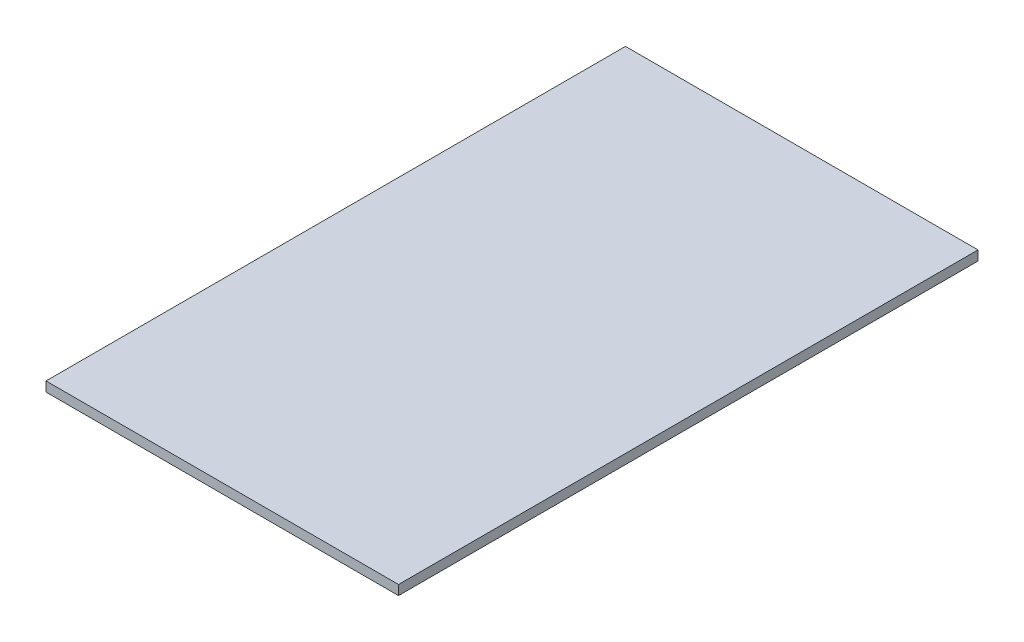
ISO-10303-21;
HEADER;
FILE_DESCRIPTION(('STEP AP214'),'2;1');
FILE_NAME('part.step','',(''),(''),'','','');
FILE_SCHEMA(('AUTOMOTIVE_DESIGN { 1 0 10303 214 1 1 1 1 }'));
ENDSEC;
DATA;
#1=APPLICATION_CONTEXT('core data for automotive mechanical design processes');
#2=APPLICATION_PROTOCOL_DEFINITION('international standard','automotive_design',2000,#1);
#3=PRODUCT_CONTEXT('',#1,'mechanical');
#4=PRODUCT('Part','Part','',(#3));
#5=PRODUCT_RELATED_PRODUCT_CATEGORY('part','',(#4));
#6=PRODUCT_DEFINITION_FORMATION('','',#4);
#7=PRODUCT_DEFINITION_CONTEXT('part definition',#1,'design');
#8=PRODUCT_DEFINITION('design','',#6,#7);
#9=PRODUCT_DEFINITION_SHAPE('','',#8);
#10=(LENGTH_UNIT() NAMED_UNIT(*) SI_UNIT(.MILLI.,.METRE.));
#11=(NAMED_UNIT(*) PLANE_ANGLE_UNIT() SI_UNIT($,.RADIAN.));
#12=(NAMED_UNIT(*) SI_UNIT($,.STERADIAN.) SOLID_ANGLE_UNIT());
#13=UNCERTAINTY_MEASURE_WITH_UNIT(LENGTH_MEASURE(1.E-05),#10,'distance_accuracy_value','');
#14=(GEOMETRIC_REPRESENTATION_CONTEXT(3) GLOBAL_UNCERTAINTY_ASSIGNED_CONTEXT((#13)) GLOBAL_UNIT_ASSIGNED_CONTEXT((#10,
#11,#12)) REPRESENTATION_CONTEXT('',''));
#15=CARTESIAN_POINT('',(0.,0.,0.));
#16=DIRECTION('',(0.,0.,1.));
#17=DIRECTION('',(1.,0.,0.));
#18=AXIS2_PLACEMENT_3D('',#15,#16,#17);
#19=CARTESIAN_POINT('',(0.,25.4,0.));
#20=DIRECTION('',(1.,0.,0.));
#21=DIRECTION('',(0.,0.,-1.));
#22=AXIS2_PLACEMENT_3D('',#19,#20,#21);
#23=PLANE('',#22);
#24=DIRECTION('',(0.,0.,1.));
#25=VECTOR('',#24,1.);
#26=CARTESIAN_POINT('',(0.,0.,0.));
#27=LINE('',#26,#25);
#28=CARTESIAN_POINT('',(0.,0.,-1524.));
#29=VERTEX_POINT('',#28);
#30=CARTESIAN_POINT('',(0.,0.,0.));
#31=VERTEX_POINT('',#30);
#32=EDGE_CURVE('E100',#29,#31,#27,.T.);
#33=ORIENTED_EDGE('',*,*,#32,.T.);
#34=DIRECTION('',(0.,-1.,0.));
#35=VECTOR('',#34,1.);
#36=CARTESIAN_POINT('',(0.,25.4,0.));
#37=LINE('',#36,#35);
#38=CARTESIAN_POINT('',(0.,25.4,0.));
#39=VERTEX_POINT('',#38);
#40=EDGE_CURVE('E11',#39,#31,#37,.T.);
#41=ORIENTED_EDGE('',*,*,#40,.F.);
#42=DIRECTION('',(0.,0.,1.));
#43=VECTOR('',#42,1.);
#44=CARTESIAN_POINT('',(0.,25.4,0.));
#45=LINE('',#44,#43);
#46=CARTESIAN_POINT('',(0.,25.4,-1524.));
#47=VERTEX_POINT('',#46);
#48=EDGE_CURVE('E88',#47,#39,#45,.T.);
#49=ORIENTED_EDGE('',*,*,#48,.F.);
#50=DIRECTION('',(0.,-1.,0.));
#51=VECTOR('',#50,1.);
#52=CARTESIAN_POINT('',(0.,25.4,-1524.));
#53=LINE('',#52,#51);
#54=EDGE_CURVE('E96',#47,#29,#53,.T.);
#55=ORIENTED_EDGE('',*,*,#54,.T.);
#56=EDGE_LOOP('',(#33,#41,#49,#55));
#57=FACE_BOUND('',#56,.T.);
#58=ADVANCED_FACE('F37',(#57),#23,.F.);
#59=CARTESIAN_POINT('',(0.,25.4,0.));
#60=DIRECTION('',(0.,0.,-1.));
#61=DIRECTION('',(-1.,0.,0.));
#62=AXIS2_PLACEMENT_3D('',#59,#60,#61);
#63=PLANE('',#62);
#64=DIRECTION('',(1.,0.,0.));
#65=VECTOR('',#64,1.);
#66=CARTESIAN_POINT('',(0.,0.,0.));
#67=LINE('',#66,#65);
#68=CARTESIAN_POINT('',(927.1,0.,0.));
#69=VERTEX_POINT('',#68);
#70=EDGE_CURVE('E92',#31,#69,#67,.T.);
#71=ORIENTED_EDGE('',*,*,#70,.T.);
#72=DIRECTION('',(0.,-1.,0.));
#73=VECTOR('',#72,1.);
#74=CARTESIAN_POINT('',(927.1,25.4,0.));
#75=LINE('',#74,#73);
#76=CARTESIAN_POINT('',(927.1,25.4,0.));
#77=VERTEX_POINT('',#76);
#78=EDGE_CURVE('E45',#77,#69,#75,.T.);
#79=ORIENTED_EDGE('',*,*,#78,.F.);
#80=DIRECTION('',(1.,0.,0.));
#81=VECTOR('',#80,1.);
#82=CARTESIAN_POINT('',(0.,25.4,0.));
#83=LINE('',#82,#81);
#84=EDGE_CURVE('E83',#39,#77,#83,.T.);
#85=ORIENTED_EDGE('',*,*,#84,.F.);
#86=ORIENTED_EDGE('',*,*,#40,.T.);
#87=EDGE_LOOP('',(#71,#79,#85,#86));
#88=FACE_BOUND('',#87,.T.);
#89=ADVANCED_FACE('F91',(#88),#63,.F.);
#90=CARTESIAN_POINT('',(927.1,25.4,0.));
#91=DIRECTION('',(-1.,0.,0.));
#92=DIRECTION('',(0.,0.,1.));
#93=AXIS2_PLACEMENT_3D('',#90,#91,#92);
#94=PLANE('',#93);
#95=DIRECTION('',(0.,0.,-1.));
#96=VECTOR('',#95,1.);
#97=CARTESIAN_POINT('',(927.1,0.,0.));
#98=LINE('',#97,#96);
#99=CARTESIAN_POINT('',(927.1,0.,-1524.));
#100=VERTEX_POINT('',#99);
#101=EDGE_CURVE('E70',#69,#100,#98,.T.);
#102=ORIENTED_EDGE('',*,*,#101,.T.);
#103=DIRECTION('',(0.,-1.,0.));
#104=VECTOR('',#103,1.);
#105=CARTESIAN_POINT('',(927.1,25.4,-1524.));
#106=LINE('',#105,#104);
#107=CARTESIAN_POINT('',(927.1,25.4,-1524.));
#108=VERTEX_POINT('',#107);
#109=EDGE_CURVE('E93',#108,#100,#106,.T.);
#110=ORIENTED_EDGE('',*,*,#109,.F.);
#111=DIRECTION('',(0.,0.,-1.));
#112=VECTOR('',#111,1.);
#113=CARTESIAN_POINT('',(927.1,25.4,0.));
#114=LINE('',#113,#112);
#115=EDGE_CURVE('E86',#77,#108,#114,.T.);
#116=ORIENTED_EDGE('',*,*,#115,.F.);
#117=ORIENTED_EDGE('',*,*,#78,.T.);
#118=EDGE_LOOP('',(#102,#110,#116,#117));
#119=FACE_BOUND('',#118,.T.);
#120=ADVANCED_FACE('F94',(#119),#94,.F.);
#121=CARTESIAN_POINT('',(0.,25.4,-1524.));
#122=DIRECTION('',(0.,0.,1.));
#123=DIRECTION('',(1.,0.,0.));
#124=AXIS2_PLACEMENT_3D('',#121,#122,#123);
#125=PLANE('',#124);
#126=DIRECTION('',(-1.,0.,0.));
#127=VECTOR('',#126,1.);
#128=CARTESIAN_POINT('',(0.,0.,-1524.));
#129=LINE('',#128,#127);
#130=EDGE_CURVE('E76',#100,#29,#129,.T.);
#131=ORIENTED_EDGE('',*,*,#130,.T.);
#132=ORIENTED_EDGE('',*,*,#54,.F.);
#133=DIRECTION('',(-1.,0.,0.));
#134=VECTOR('',#133,1.);
#135=CARTESIAN_POINT('',(0.,25.4,-1524.));
#136=LINE('',#135,#134);
#137=EDGE_CURVE('E53',#108,#47,#136,.T.);
#138=ORIENTED_EDGE('',*,*,#137,.F.);
#139=ORIENTED_EDGE('',*,*,#109,.T.);
#140=EDGE_LOOP('',(#131,#132,#138,#139));
#141=FACE_BOUND('',#140,.T.);
#142=ADVANCED_FACE('F107',(#141),#125,.F.);
#143=CARTESIAN_POINT('',(0.,25.4,0.));
#144=DIRECTION('',(0.,-1.,0.));
#145=DIRECTION('',(0.,0.,-1.));
#146=AXIS2_PLACEMENT_3D('',#143,#144,#145);
#147=PLANE('',#146);
#148=ORIENTED_EDGE('',*,*,#48,.T.);
#149=ORIENTED_EDGE('',*,*,#84,.T.);
#150=ORIENTED_EDGE('',*,*,#115,.T.);
#151=ORIENTED_EDGE('',*,*,#137,.T.);
#152=EDGE_LOOP('',(#148,#149,#150,#151));
#153=FACE_BOUND('',#152,.T.);
#154=ADVANCED_FACE('F84',(#153),#147,.F.);
#155=CARTESIAN_POINT('',(0.,0.,0.));
#156=DIRECTION('',(0.,-1.,0.));
#157=DIRECTION('',(0.,0.,-1.));
#158=AXIS2_PLACEMENT_3D('',#155,#156,#157);
#159=PLANE('',#158);
#160=ORIENTED_EDGE('',*,*,#32,.F.);
#161=ORIENTED_EDGE('',*,*,#130,.F.);
#162=ORIENTED_EDGE('',*,*,#101,.F.);
#163=ORIENTED_EDGE('',*,*,#70,.F.);
#164=EDGE_LOOP('',(#160,#161,#162,#163));
#165=FACE_BOUND('',#164,.T.);
#166=ADVANCED_FACE('F110',(#165),#159,.T.);
#167=CLOSED_SHELL('',(#58,#89,#120,#142,#154,#166));
#168=MANIFOLD_SOLID_BREP('B2',#167);
#169=ADVANCED_BREP_SHAPE_REPRESENTATION('',(#18,#168),#14);
#170=SHAPE_DEFINITION_REPRESENTATION(#9,#169);
ENDSEC;
END-ISO-10303-21;
